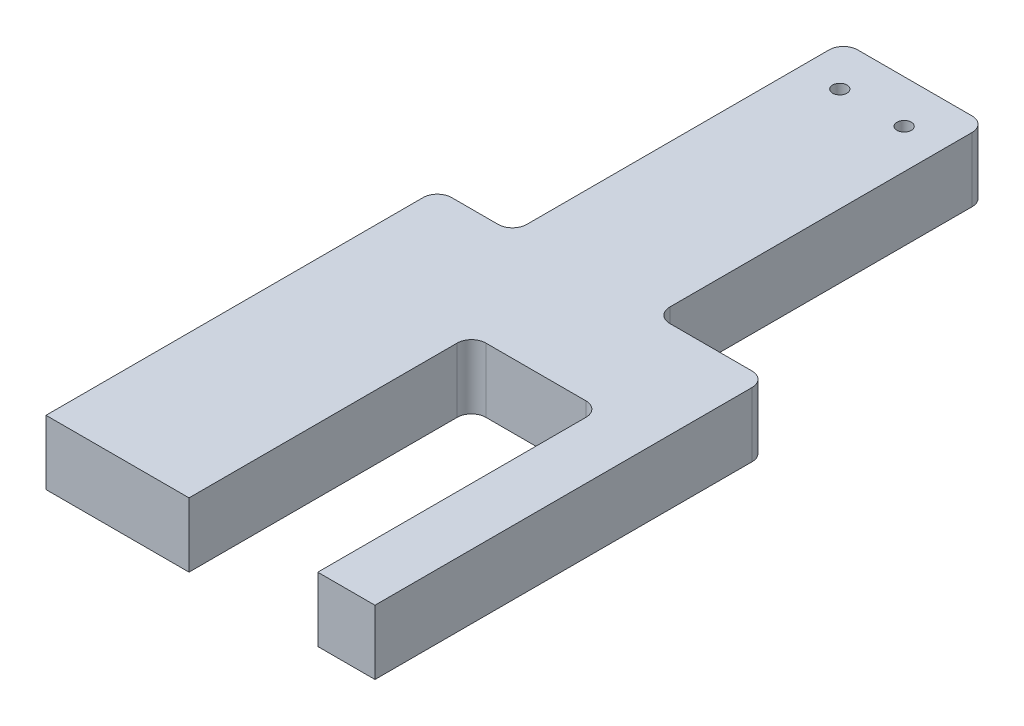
ISO-10303-21;
HEADER;
FILE_DESCRIPTION(('STEP AP214'),'2;1');
FILE_NAME('part.step','',(''),(''),'','','');
FILE_SCHEMA(('AUTOMOTIVE_DESIGN { 1 0 10303 214 1 1 1 1 }'));
ENDSEC;
DATA;
#1=APPLICATION_CONTEXT('core data for automotive mechanical design processes');
#2=APPLICATION_PROTOCOL_DEFINITION('international standard','automotive_design',2000,#1);
#3=PRODUCT_CONTEXT('',#1,'mechanical');
#4=PRODUCT('Part','Part','',(#3));
#5=PRODUCT_RELATED_PRODUCT_CATEGORY('part','',(#4));
#6=PRODUCT_DEFINITION_FORMATION('','',#4);
#7=PRODUCT_DEFINITION_CONTEXT('part definition',#1,'design');
#8=PRODUCT_DEFINITION('design','',#6,#7);
#9=PRODUCT_DEFINITION_SHAPE('','',#8);
#10=(LENGTH_UNIT() NAMED_UNIT(*) SI_UNIT(.MILLI.,.METRE.));
#11=(NAMED_UNIT(*) PLANE_ANGLE_UNIT() SI_UNIT($,.RADIAN.));
#12=(NAMED_UNIT(*) SI_UNIT($,.STERADIAN.) SOLID_ANGLE_UNIT());
#13=UNCERTAINTY_MEASURE_WITH_UNIT(LENGTH_MEASURE(1.E-05),#10,'distance_accuracy_value','');
#14=(GEOMETRIC_REPRESENTATION_CONTEXT(3) GLOBAL_UNCERTAINTY_ASSIGNED_CONTEXT((#13)) GLOBAL_UNIT_ASSIGNED_CONTEXT((#10,
#11,#12)) REPRESENTATION_CONTEXT('',''));
#15=CARTESIAN_POINT('',(0.,0.,0.));
#16=DIRECTION('',(0.,0.,1.));
#17=DIRECTION('',(1.,0.,0.));
#18=AXIS2_PLACEMENT_3D('',#15,#16,#17);
#19=CARTESIAN_POINT('',(0.,9.,0.));
#20=DIRECTION('',(0.,-1.,0.));
#21=DIRECTION('',(0.,0.,-1.));
#22=AXIS2_PLACEMENT_3D('',#19,#20,#21);
#23=PLANE('',#22);
#24=DIRECTION('',(0.,0.,-1.));
#25=VECTOR('',#24,1.);
#26=CARTESIAN_POINT('',(17.,9.,39.5));
#27=LINE('',#26,#25);
#28=CARTESIAN_POINT('',(17.,9.,39.5));
#29=VERTEX_POINT('',#28);
#30=CARTESIAN_POINT('',(17.,9.,-13.2275954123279));
#31=VERTEX_POINT('',#30);
#32=EDGE_CURVE('E241',#29,#31,#27,.T.);
#33=ORIENTED_EDGE('',*,*,#32,.T.);
#34=CARTESIAN_POINT('',(15.,9.,-13.2275954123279));
#35=DIRECTION('',(0.,-1.,0.));
#36=DIRECTION('',(0.,0.,-1.));
#37=AXIS2_PLACEMENT_3D('',#34,#35,#36);
#38=CIRCLE('',#37,2.);
#39=CARTESIAN_POINT('',(15.,9.,-15.2275954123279));
#40=VERTEX_POINT('',#39);
#41=EDGE_CURVE('E272',#31,#40,#38,.F.);
#42=ORIENTED_EDGE('',*,*,#41,.T.);
#43=DIRECTION('',(-1.,0.,0.));
#44=VECTOR('',#43,1.);
#45=CARTESIAN_POINT('',(1.5,9.,-15.2275954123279));
#46=LINE('',#45,#44);
#47=CARTESIAN_POINT('',(3.5,9.,-15.2275954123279));
#48=VERTEX_POINT('',#47);
#49=EDGE_CURVE('E339',#40,#48,#46,.T.);
#50=ORIENTED_EDGE('',*,*,#49,.T.);
#51=CARTESIAN_POINT('',(3.5,9.,-17.2275954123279));
#52=DIRECTION('',(0.,-1.,0.));
#53=DIRECTION('',(0.,0.,-1.));
#54=AXIS2_PLACEMENT_3D('',#51,#52,#53);
#55=CIRCLE('',#54,2.);
#56=CARTESIAN_POINT('',(1.5,9.,-17.2275954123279));
#57=VERTEX_POINT('',#56);
#58=EDGE_CURVE('E302',#48,#57,#55,.T.);
#59=ORIENTED_EDGE('',*,*,#58,.T.);
#60=DIRECTION('',(0.,0.,-1.));
#61=VECTOR('',#60,1.);
#62=CARTESIAN_POINT('',(1.49999999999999,9.,-61.5));
#63=LINE('',#62,#61);
#64=CARTESIAN_POINT('',(1.49999999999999,9.,-59.5));
#65=VERTEX_POINT('',#64);
#66=EDGE_CURVE('E336',#57,#65,#63,.T.);
#67=ORIENTED_EDGE('',*,*,#66,.T.);
#68=CARTESIAN_POINT('',(-0.500000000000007,9.,-59.5));
#69=DIRECTION('',(0.,-1.,0.));
#70=DIRECTION('',(0.,0.,-1.));
#71=AXIS2_PLACEMENT_3D('',#68,#69,#70);
#72=CIRCLE('',#71,2.);
#73=CARTESIAN_POINT('',(-0.500000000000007,9.,-61.5));
#74=VERTEX_POINT('',#73);
#75=EDGE_CURVE('E268',#65,#74,#72,.F.);
#76=ORIENTED_EDGE('',*,*,#75,.T.);
#77=DIRECTION('',(-1.,0.,0.));
#78=VECTOR('',#77,1.);
#79=CARTESIAN_POINT('',(-18.5,9.,-61.5));
#80=LINE('',#79,#78);
#81=CARTESIAN_POINT('',(-16.5,9.,-61.5));
#82=VERTEX_POINT('',#81);
#83=EDGE_CURVE('E331',#74,#82,#80,.T.);
#84=ORIENTED_EDGE('',*,*,#83,.T.);
#85=CARTESIAN_POINT('',(-16.5,9.,-59.5));
#86=DIRECTION('',(0.,-1.,0.));
#87=DIRECTION('',(0.,0.,-1.));
#88=AXIS2_PLACEMENT_3D('',#85,#86,#87);
#89=CIRCLE('',#88,2.);
#90=CARTESIAN_POINT('',(-18.5,9.,-59.5));
#91=VERTEX_POINT('',#90);
#92=EDGE_CURVE('E270',#82,#91,#89,.F.);
#93=ORIENTED_EDGE('',*,*,#92,.T.);
#94=DIRECTION('',(0.,0.,1.));
#95=VECTOR('',#94,1.);
#96=CARTESIAN_POINT('',(-18.5,9.,-15.2275954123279));
#97=LINE('',#96,#95);
#98=CARTESIAN_POINT('',(-18.5,9.,-17.2275954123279));
#99=VERTEX_POINT('',#98);
#100=EDGE_CURVE('E327',#91,#99,#97,.T.);
#101=ORIENTED_EDGE('',*,*,#100,.T.);
#102=CARTESIAN_POINT('',(-20.5,9.,-17.2275954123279));
#103=DIRECTION('',(0.,-1.,0.));
#104=DIRECTION('',(0.,0.,-1.));
#105=AXIS2_PLACEMENT_3D('',#102,#103,#104);
#106=CIRCLE('',#105,2.);
#107=CARTESIAN_POINT('',(-20.5,9.,-15.2275954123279));
#108=VERTEX_POINT('',#107);
#109=EDGE_CURVE('E11',#99,#108,#106,.T.);
#110=ORIENTED_EDGE('',*,*,#109,.T.);
#111=DIRECTION('',(-1.,0.,0.));
#112=VECTOR('',#111,1.);
#113=CARTESIAN_POINT('',(-29.,9.,-15.2275954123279));
#114=LINE('',#113,#112);
#115=CARTESIAN_POINT('',(-27.,9.,-15.2275954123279));
#116=VERTEX_POINT('',#115);
#117=EDGE_CURVE('E183',#108,#116,#114,.T.);
#118=ORIENTED_EDGE('',*,*,#117,.T.);
#119=CARTESIAN_POINT('',(-27.,9.,-13.2275954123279));
#120=DIRECTION('',(0.,-1.,0.));
#121=DIRECTION('',(0.,0.,-1.));
#122=AXIS2_PLACEMENT_3D('',#119,#120,#121);
#123=CIRCLE('',#122,2.);
#124=CARTESIAN_POINT('',(-29.,9.,-13.2275954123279));
#125=VERTEX_POINT('',#124);
#126=EDGE_CURVE('E179',#116,#125,#123,.F.);
#127=ORIENTED_EDGE('',*,*,#126,.T.);
#128=DIRECTION('',(0.,0.,1.));
#129=VECTOR('',#128,1.);
#130=CARTESIAN_POINT('',(-29.,9.,39.5));
#131=LINE('',#130,#129);
#132=CARTESIAN_POINT('',(-29.,9.,39.5));
#133=VERTEX_POINT('',#132);
#134=EDGE_CURVE('E169',#125,#133,#131,.T.);
#135=ORIENTED_EDGE('',*,*,#134,.T.);
#136=DIRECTION('',(1.,0.,0.));
#137=VECTOR('',#136,1.);
#138=CARTESIAN_POINT('',(-8.99999999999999,9.,39.5));
#139=LINE('',#138,#137);
#140=CARTESIAN_POINT('',(-8.99999999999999,9.,39.5));
#141=VERTEX_POINT('',#140);
#142=EDGE_CURVE('E175',#133,#141,#139,.T.);
#143=ORIENTED_EDGE('',*,*,#142,.T.);
#144=DIRECTION('',(0.,0.,-1.));
#145=VECTOR('',#144,1.);
#146=CARTESIAN_POINT('',(-9.,9.,0.));
#147=LINE('',#146,#145);
#148=CARTESIAN_POINT('',(-9.,9.,2.));
#149=VERTEX_POINT('',#148);
#150=EDGE_CURVE('E198',#141,#149,#147,.T.);
#151=ORIENTED_EDGE('',*,*,#150,.T.);
#152=CARTESIAN_POINT('',(-7.,9.,2.));
#153=DIRECTION('',(0.,-1.,0.));
#154=DIRECTION('',(0.,0.,-1.));
#155=AXIS2_PLACEMENT_3D('',#152,#153,#154);
#156=CIRCLE('',#155,2.);
#157=CARTESIAN_POINT('',(-7.,9.,0.));
#158=VERTEX_POINT('',#157);
#159=EDGE_CURVE('E309',#149,#158,#156,.T.);
#160=ORIENTED_EDGE('',*,*,#159,.T.);
#161=DIRECTION('',(1.,0.,0.));
#162=VECTOR('',#161,1.);
#163=CARTESIAN_POINT('',(-9.,9.,0.));
#164=LINE('',#163,#162);
#165=CARTESIAN_POINT('',(7.,9.,0.));
#166=VERTEX_POINT('',#165);
#167=EDGE_CURVE('E200',#158,#166,#164,.T.);
#168=ORIENTED_EDGE('',*,*,#167,.T.);
#169=CARTESIAN_POINT('',(7.,9.,2.));
#170=DIRECTION('',(0.,-1.,0.));
#171=DIRECTION('',(0.,0.,-1.));
#172=AXIS2_PLACEMENT_3D('',#169,#170,#171);
#173=CIRCLE('',#172,2.);
#174=CARTESIAN_POINT('',(9.,9.,2.));
#175=VERTEX_POINT('',#174);
#176=EDGE_CURVE('E48',#166,#175,#173,.T.);
#177=ORIENTED_EDGE('',*,*,#176,.T.);
#178=DIRECTION('',(0.,0.,1.));
#179=VECTOR('',#178,1.);
#180=CARTESIAN_POINT('',(9.,9.,0.));
#181=LINE('',#180,#179);
#182=CARTESIAN_POINT('',(9.00000000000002,9.,39.5));
#183=VERTEX_POINT('',#182);
#184=EDGE_CURVE('E205',#175,#183,#181,.T.);
#185=ORIENTED_EDGE('',*,*,#184,.T.);
#186=DIRECTION('',(1.,0.,0.));
#187=VECTOR('',#186,1.);
#188=CARTESIAN_POINT('',(9.00000000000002,9.,39.5));
#189=LINE('',#188,#187);
#190=EDGE_CURVE('E207',#183,#29,#189,.T.);
#191=ORIENTED_EDGE('',*,*,#190,.T.);
#192=EDGE_LOOP('',(#33,#42,#50,#59,#67,#76,#84,#93,#101,#110,#118,#127,#135,#143,#151,#160,#168,
#177,#185,#191));
#193=FACE_BOUND('',#192,.T.);
#194=CARTESIAN_POINT('',(-4.00000000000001,9.,-55.5));
#195=DIRECTION('',(0.,1.,0.));
#196=DIRECTION('',(0.,0.,1.));
#197=AXIS2_PLACEMENT_3D('',#194,#195,#196);
#198=CIRCLE('',#197,1.);
#199=CARTESIAN_POINT('',(-4.00000000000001,9.,-54.5));
#200=VERTEX_POINT('',#199);
#201=EDGE_CURVE('E214',#200,#200,#198,.T.);
#202=ORIENTED_EDGE('',*,*,#201,.F.);
#203=EDGE_LOOP('',(#202));
#204=FACE_BOUND('',#203,.T.);
#205=CARTESIAN_POINT('',(-13.,9.,-55.5));
#206=DIRECTION('',(0.,1.,0.));
#207=DIRECTION('',(0.,0.,1.));
#208=AXIS2_PLACEMENT_3D('',#205,#206,#207);
#209=CIRCLE('',#208,1.);
#210=CARTESIAN_POINT('',(-13.,9.,-54.5));
#211=VERTEX_POINT('',#210);
#212=EDGE_CURVE('E346',#211,#211,#209,.T.);
#213=ORIENTED_EDGE('',*,*,#212,.F.);
#214=EDGE_LOOP('',(#213));
#215=FACE_BOUND('',#214,.T.);
#216=ADVANCED_FACE('F33',(#193,#204,#215),#23,.F.);
#217=CARTESIAN_POINT('',(0.,0.,0.));
#218=DIRECTION('',(0.,-1.,0.));
#219=DIRECTION('',(0.,0.,-1.));
#220=AXIS2_PLACEMENT_3D('',#217,#218,#219);
#221=PLANE('',#220);
#222=CARTESIAN_POINT('',(-4.00000000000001,0.,-55.5));
#223=DIRECTION('',(0.,1.,0.));
#224=DIRECTION('',(0.,0.,1.));
#225=AXIS2_PLACEMENT_3D('',#222,#223,#224);
#226=CIRCLE('',#225,1.);
#227=CARTESIAN_POINT('',(-4.00000000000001,0.,-54.5));
#228=VERTEX_POINT('',#227);
#229=EDGE_CURVE('E343',#228,#228,#226,.T.);
#230=ORIENTED_EDGE('',*,*,#229,.T.);
#231=EDGE_LOOP('',(#230));
#232=FACE_BOUND('',#231,.T.);
#233=DIRECTION('',(-1.,0.,0.));
#234=VECTOR('',#233,1.);
#235=CARTESIAN_POINT('',(1.5,0.,-15.2275954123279));
#236=LINE('',#235,#234);
#237=CARTESIAN_POINT('',(15.,0.,-15.2275954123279));
#238=VERTEX_POINT('',#237);
#239=CARTESIAN_POINT('',(3.5,0.,-15.2275954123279));
#240=VERTEX_POINT('',#239);
#241=EDGE_CURVE('E213',#238,#240,#236,.T.);
#242=ORIENTED_EDGE('',*,*,#241,.F.);
#243=CARTESIAN_POINT('',(15.,0.,-13.2275954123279));
#244=DIRECTION('',(0.,-1.,0.));
#245=DIRECTION('',(0.,0.,-1.));
#246=AXIS2_PLACEMENT_3D('',#243,#244,#245);
#247=CIRCLE('',#246,2.);
#248=CARTESIAN_POINT('',(17.,0.,-13.2275954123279));
#249=VERTEX_POINT('',#248);
#250=EDGE_CURVE('E263',#238,#249,#247,.T.);
#251=ORIENTED_EDGE('',*,*,#250,.T.);
#252=DIRECTION('',(0.,0.,-1.));
#253=VECTOR('',#252,1.);
#254=CARTESIAN_POINT('',(17.,0.,39.5));
#255=LINE('',#254,#253);
#256=CARTESIAN_POINT('',(17.,0.,39.5));
#257=VERTEX_POINT('',#256);
#258=EDGE_CURVE('E210',#257,#249,#255,.T.);
#259=ORIENTED_EDGE('',*,*,#258,.F.);
#260=DIRECTION('',(1.,0.,0.));
#261=VECTOR('',#260,1.);
#262=CARTESIAN_POINT('',(9.00000000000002,0.,39.5));
#263=LINE('',#262,#261);
#264=CARTESIAN_POINT('',(9.00000000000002,0.,39.5));
#265=VERTEX_POINT('',#264);
#266=EDGE_CURVE('E239',#265,#257,#263,.T.);
#267=ORIENTED_EDGE('',*,*,#266,.F.);
#268=DIRECTION('',(0.,0.,1.));
#269=VECTOR('',#268,1.);
#270=CARTESIAN_POINT('',(9.,0.,0.));
#271=LINE('',#270,#269);
#272=CARTESIAN_POINT('',(9.,0.,2.));
#273=VERTEX_POINT('',#272);
#274=EDGE_CURVE('E237',#273,#265,#271,.T.);
#275=ORIENTED_EDGE('',*,*,#274,.F.);
#276=CARTESIAN_POINT('',(7.,0.,2.));
#277=DIRECTION('',(0.,-1.,0.));
#278=DIRECTION('',(0.,0.,-1.));
#279=AXIS2_PLACEMENT_3D('',#276,#277,#278);
#280=CIRCLE('',#279,2.);
#281=CARTESIAN_POINT('',(7.,0.,0.));
#282=VERTEX_POINT('',#281);
#283=EDGE_CURVE('E304',#273,#282,#280,.F.);
#284=ORIENTED_EDGE('',*,*,#283,.T.);
#285=DIRECTION('',(1.,0.,0.));
#286=VECTOR('',#285,1.);
#287=CARTESIAN_POINT('',(-9.,0.,0.));
#288=LINE('',#287,#286);
#289=CARTESIAN_POINT('',(-7.,0.,0.));
#290=VERTEX_POINT('',#289);
#291=EDGE_CURVE('E235',#290,#282,#288,.T.);
#292=ORIENTED_EDGE('',*,*,#291,.F.);
#293=CARTESIAN_POINT('',(-7.,0.,2.));
#294=DIRECTION('',(0.,-1.,0.));
#295=DIRECTION('',(0.,0.,-1.));
#296=AXIS2_PLACEMENT_3D('',#293,#294,#295);
#297=CIRCLE('',#296,2.);
#298=CARTESIAN_POINT('',(-9.,0.,2.));
#299=VERTEX_POINT('',#298);
#300=EDGE_CURVE('E307',#290,#299,#297,.F.);
#301=ORIENTED_EDGE('',*,*,#300,.T.);
#302=DIRECTION('',(0.,0.,-1.));
#303=VECTOR('',#302,1.);
#304=CARTESIAN_POINT('',(-9.,0.,0.));
#305=LINE('',#304,#303);
#306=CARTESIAN_POINT('',(-8.99999999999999,0.,39.5));
#307=VERTEX_POINT('',#306);
#308=EDGE_CURVE('E232',#307,#299,#305,.T.);
#309=ORIENTED_EDGE('',*,*,#308,.F.);
#310=DIRECTION('',(1.,0.,0.));
#311=VECTOR('',#310,1.);
#312=CARTESIAN_POINT('',(-8.99999999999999,0.,39.5));
#313=LINE('',#312,#311);
#314=CARTESIAN_POINT('',(-29.,0.,39.5));
#315=VERTEX_POINT('',#314);
#316=EDGE_CURVE('E230',#315,#307,#313,.T.);
#317=ORIENTED_EDGE('',*,*,#316,.F.);
#318=DIRECTION('',(0.,0.,1.));
#319=VECTOR('',#318,1.);
#320=CARTESIAN_POINT('',(-29.,0.,39.5));
#321=LINE('',#320,#319);
#322=CARTESIAN_POINT('',(-29.,0.,-13.2275954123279));
#323=VERTEX_POINT('',#322);
#324=EDGE_CURVE('E189',#323,#315,#321,.T.);
#325=ORIENTED_EDGE('',*,*,#324,.F.);
#326=CARTESIAN_POINT('',(-27.,0.,-13.2275954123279));
#327=DIRECTION('',(0.,-1.,0.));
#328=DIRECTION('',(0.,0.,-1.));
#329=AXIS2_PLACEMENT_3D('',#326,#327,#328);
#330=CIRCLE('',#329,2.);
#331=CARTESIAN_POINT('',(-27.,0.,-15.2275954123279));
#332=VERTEX_POINT('',#331);
#333=EDGE_CURVE('E257',#323,#332,#330,.T.);
#334=ORIENTED_EDGE('',*,*,#333,.T.);
#335=DIRECTION('',(-1.,0.,0.));
#336=VECTOR('',#335,1.);
#337=CARTESIAN_POINT('',(-29.,0.,-15.2275954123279));
#338=LINE('',#337,#336);
#339=CARTESIAN_POINT('',(-20.5,0.,-15.2275954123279));
#340=VERTEX_POINT('',#339);
#341=EDGE_CURVE('E226',#340,#332,#338,.T.);
#342=ORIENTED_EDGE('',*,*,#341,.F.);
#343=CARTESIAN_POINT('',(-20.5,0.,-17.2275954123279));
#344=DIRECTION('',(0.,-1.,0.));
#345=DIRECTION('',(0.,0.,-1.));
#346=AXIS2_PLACEMENT_3D('',#343,#344,#345);
#347=CIRCLE('',#346,2.);
#348=CARTESIAN_POINT('',(-18.5,0.,-17.2275954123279));
#349=VERTEX_POINT('',#348);
#350=EDGE_CURVE('E41',#340,#349,#347,.F.);
#351=ORIENTED_EDGE('',*,*,#350,.T.);
#352=DIRECTION('',(0.,0.,1.));
#353=VECTOR('',#352,1.);
#354=CARTESIAN_POINT('',(-18.5,0.,-15.2275954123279));
#355=LINE('',#354,#353);
#356=CARTESIAN_POINT('',(-18.5,0.,-59.5));
#357=VERTEX_POINT('',#356);
#358=EDGE_CURVE('E223',#357,#349,#355,.T.);
#359=ORIENTED_EDGE('',*,*,#358,.F.);
#360=CARTESIAN_POINT('',(-16.5,0.,-59.5));
#361=DIRECTION('',(0.,-1.,0.));
#362=DIRECTION('',(0.,0.,-1.));
#363=AXIS2_PLACEMENT_3D('',#360,#361,#362);
#364=CIRCLE('',#363,2.);
#365=CARTESIAN_POINT('',(-16.5,0.,-61.5));
#366=VERTEX_POINT('',#365);
#367=EDGE_CURVE('E261',#357,#366,#364,.T.);
#368=ORIENTED_EDGE('',*,*,#367,.T.);
#369=DIRECTION('',(-1.,0.,0.));
#370=VECTOR('',#369,1.);
#371=CARTESIAN_POINT('',(-18.5,0.,-61.5));
#372=LINE('',#371,#370);
#373=CARTESIAN_POINT('',(-0.500000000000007,0.,-61.5));
#374=VERTEX_POINT('',#373);
#375=EDGE_CURVE('E220',#374,#366,#372,.T.);
#376=ORIENTED_EDGE('',*,*,#375,.F.);
#377=CARTESIAN_POINT('',(-0.500000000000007,0.,-59.5));
#378=DIRECTION('',(0.,-1.,0.));
#379=DIRECTION('',(0.,0.,-1.));
#380=AXIS2_PLACEMENT_3D('',#377,#378,#379);
#381=CIRCLE('',#380,2.);
#382=CARTESIAN_POINT('',(1.49999999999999,0.,-59.5));
#383=VERTEX_POINT('',#382);
#384=EDGE_CURVE('E259',#374,#383,#381,.T.);
#385=ORIENTED_EDGE('',*,*,#384,.T.);
#386=DIRECTION('',(0.,0.,-1.));
#387=VECTOR('',#386,1.);
#388=CARTESIAN_POINT('',(1.49999999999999,0.,-61.5));
#389=LINE('',#388,#387);
#390=CARTESIAN_POINT('',(1.5,0.,-17.2275954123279));
#391=VERTEX_POINT('',#390);
#392=EDGE_CURVE('E217',#391,#383,#389,.T.);
#393=ORIENTED_EDGE('',*,*,#392,.F.);
#394=CARTESIAN_POINT('',(3.5,0.,-17.2275954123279));
#395=DIRECTION('',(0.,-1.,0.));
#396=DIRECTION('',(0.,0.,-1.));
#397=AXIS2_PLACEMENT_3D('',#394,#395,#396);
#398=CIRCLE('',#397,2.);
#399=EDGE_CURVE('E300',#391,#240,#398,.F.);
#400=ORIENTED_EDGE('',*,*,#399,.T.);
#401=EDGE_LOOP('',(#242,#251,#259,#267,#275,#284,#292,#301,#309,#317,#325,#334,#342,#351,#359,
#368,#376,#385,#393,#400));
#402=FACE_BOUND('',#401,.T.);
#403=CARTESIAN_POINT('',(-13.,0.,-55.5));
#404=DIRECTION('',(0.,1.,0.));
#405=DIRECTION('',(0.,0.,1.));
#406=AXIS2_PLACEMENT_3D('',#403,#404,#405);
#407=CIRCLE('',#406,1.);
#408=CARTESIAN_POINT('',(-13.,0.,-54.5));
#409=VERTEX_POINT('',#408);
#410=EDGE_CURVE('E349',#409,#409,#407,.T.);
#411=ORIENTED_EDGE('',*,*,#410,.T.);
#412=EDGE_LOOP('',(#411));
#413=FACE_BOUND('',#412,.T.);
#414=ADVANCED_FACE('F314',(#232,#402,#413),#221,.T.);
#415=CARTESIAN_POINT('',(17.,9.,39.5));
#416=DIRECTION('',(-1.,0.,0.));
#417=DIRECTION('',(0.,0.,1.));
#418=AXIS2_PLACEMENT_3D('',#415,#416,#417);
#419=PLANE('',#418);
#420=ORIENTED_EDGE('',*,*,#258,.T.);
#421=DIRECTION('',(0.,-1.,0.));
#422=VECTOR('',#421,1.);
#423=CARTESIAN_POINT('',(17.,9.,-13.2275954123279));
#424=LINE('',#423,#422);
#425=EDGE_CURVE('E265',#249,#31,#424,.F.);
#426=ORIENTED_EDGE('',*,*,#425,.T.);
#427=ORIENTED_EDGE('',*,*,#32,.F.);
#428=DIRECTION('',(0.,-1.,0.));
#429=VECTOR('',#428,1.);
#430=CARTESIAN_POINT('',(17.,9.,39.5));
#431=LINE('',#430,#429);
#432=EDGE_CURVE('E209',#29,#257,#431,.T.);
#433=ORIENTED_EDGE('',*,*,#432,.T.);
#434=EDGE_LOOP('',(#420,#426,#427,#433));
#435=FACE_BOUND('',#434,.T.);
#436=ADVANCED_FACE('F363',(#435),#419,.F.);
#437=CARTESIAN_POINT('',(1.5,9.,-15.2275954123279));
#438=DIRECTION('',(0.,0.,1.));
#439=DIRECTION('',(1.,0.,0.));
#440=AXIS2_PLACEMENT_3D('',#437,#438,#439);
#441=PLANE('',#440);
#442=ORIENTED_EDGE('',*,*,#241,.T.);
#443=DIRECTION('',(0.,-1.,0.));
#444=VECTOR('',#443,1.);
#445=CARTESIAN_POINT('',(3.5,9.,-15.2275954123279));
#446=LINE('',#445,#444);
#447=EDGE_CURVE('E255',#240,#48,#446,.F.);
#448=ORIENTED_EDGE('',*,*,#447,.T.);
#449=ORIENTED_EDGE('',*,*,#49,.F.);
#450=DIRECTION('',(0.,-1.,0.));
#451=VECTOR('',#450,1.);
#452=CARTESIAN_POINT('',(15.,9.,-15.2275954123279));
#453=LINE('',#452,#451);
#454=EDGE_CURVE('E252',#40,#238,#453,.T.);
#455=ORIENTED_EDGE('',*,*,#454,.T.);
#456=EDGE_LOOP('',(#442,#448,#449,#455));
#457=FACE_BOUND('',#456,.T.);
#458=ADVANCED_FACE('F400',(#457),#441,.F.);
#459=CARTESIAN_POINT('',(1.49999999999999,9.,-61.5));
#460=DIRECTION('',(-1.,0.,0.));
#461=DIRECTION('',(0.,0.,1.));
#462=AXIS2_PLACEMENT_3D('',#459,#460,#461);
#463=PLANE('',#462);
#464=ORIENTED_EDGE('',*,*,#66,.F.);
#465=DIRECTION('',(0.,-1.,0.));
#466=VECTOR('',#465,1.);
#467=CARTESIAN_POINT('',(1.5,0.,-17.2275954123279));
#468=LINE('',#467,#466);
#469=EDGE_CURVE('E249',#57,#391,#468,.T.);
#470=ORIENTED_EDGE('',*,*,#469,.T.);
#471=ORIENTED_EDGE('',*,*,#392,.T.);
#472=DIRECTION('',(0.,-1.,0.));
#473=VECTOR('',#472,1.);
#474=CARTESIAN_POINT('',(1.49999999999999,9.,-59.5));
#475=LINE('',#474,#473);
#476=EDGE_CURVE('E192',#383,#65,#475,.F.);
#477=ORIENTED_EDGE('',*,*,#476,.T.);
#478=EDGE_LOOP('',(#464,#470,#471,#477));
#479=FACE_BOUND('',#478,.T.);
#480=ADVANCED_FACE('F396',(#479),#463,.F.);
#481=CARTESIAN_POINT('',(-18.5,9.,-61.5));
#482=DIRECTION('',(0.,0.,1.));
#483=DIRECTION('',(1.,0.,0.));
#484=AXIS2_PLACEMENT_3D('',#481,#482,#483);
#485=PLANE('',#484);
#486=ORIENTED_EDGE('',*,*,#375,.T.);
#487=DIRECTION('',(0.,-1.,0.));
#488=VECTOR('',#487,1.);
#489=CARTESIAN_POINT('',(-16.5,9.,-61.5));
#490=LINE('',#489,#488);
#491=EDGE_CURVE('E291',#366,#82,#490,.F.);
#492=ORIENTED_EDGE('',*,*,#491,.T.);
#493=ORIENTED_EDGE('',*,*,#83,.F.);
#494=DIRECTION('',(0.,-1.,0.));
#495=VECTOR('',#494,1.);
#496=CARTESIAN_POINT('',(-0.500000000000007,9.,-61.5));
#497=LINE('',#496,#495);
#498=EDGE_CURVE('E288',#74,#374,#497,.T.);
#499=ORIENTED_EDGE('',*,*,#498,.T.);
#500=EDGE_LOOP('',(#486,#492,#493,#499));
#501=FACE_BOUND('',#500,.T.);
#502=ADVANCED_FACE('F393',(#501),#485,.F.);
#503=CARTESIAN_POINT('',(-18.5,9.,-15.2275954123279));
#504=DIRECTION('',(1.,0.,0.));
#505=DIRECTION('',(0.,0.,-1.));
#506=AXIS2_PLACEMENT_3D('',#503,#504,#505);
#507=PLANE('',#506);
#508=ORIENTED_EDGE('',*,*,#100,.F.);
#509=DIRECTION('',(0.,-1.,0.));
#510=VECTOR('',#509,1.);
#511=CARTESIAN_POINT('',(-18.5,9.,-59.5));
#512=LINE('',#511,#510);
#513=EDGE_CURVE('E285',#91,#357,#512,.T.);
#514=ORIENTED_EDGE('',*,*,#513,.T.);
#515=ORIENTED_EDGE('',*,*,#358,.T.);
#516=DIRECTION('',(0.,-1.,0.));
#517=VECTOR('',#516,1.);
#518=CARTESIAN_POINT('',(-18.5,9.,-17.2275954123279));
#519=LINE('',#518,#517);
#520=EDGE_CURVE('E283',#349,#99,#519,.F.);
#521=ORIENTED_EDGE('',*,*,#520,.T.);
#522=EDGE_LOOP('',(#508,#514,#515,#521));
#523=FACE_BOUND('',#522,.T.);
#524=ADVANCED_FACE('F321',(#523),#507,.F.);
#525=CARTESIAN_POINT('',(-29.,9.,-15.2275954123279));
#526=DIRECTION('',(0.,0.,1.));
#527=DIRECTION('',(1.,0.,0.));
#528=AXIS2_PLACEMENT_3D('',#525,#526,#527);
#529=PLANE('',#528);
#530=ORIENTED_EDGE('',*,*,#117,.F.);
#531=DIRECTION('',(0.,-1.,0.));
#532=VECTOR('',#531,1.);
#533=CARTESIAN_POINT('',(-20.5,0.,-15.2275954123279));
#534=LINE('',#533,#532);
#535=EDGE_CURVE('E295',#108,#340,#534,.T.);
#536=ORIENTED_EDGE('',*,*,#535,.T.);
#537=ORIENTED_EDGE('',*,*,#341,.T.);
#538=DIRECTION('',(0.,-1.,0.));
#539=VECTOR('',#538,1.);
#540=CARTESIAN_POINT('',(-27.,9.,-15.2275954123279));
#541=LINE('',#540,#539);
#542=EDGE_CURVE('E293',#332,#116,#541,.F.);
#543=ORIENTED_EDGE('',*,*,#542,.T.);
#544=EDGE_LOOP('',(#530,#536,#537,#543));
#545=FACE_BOUND('',#544,.T.);
#546=ADVANCED_FACE('F329',(#545),#529,.F.);
#547=CARTESIAN_POINT('',(-29.,9.,39.5));
#548=DIRECTION('',(1.,0.,0.));
#549=DIRECTION('',(0.,0.,-1.));
#550=AXIS2_PLACEMENT_3D('',#547,#548,#549);
#551=PLANE('',#550);
#552=ORIENTED_EDGE('',*,*,#134,.F.);
#553=DIRECTION('',(0.,-1.,0.));
#554=VECTOR('',#553,1.);
#555=CARTESIAN_POINT('',(-29.,9.,-13.2275954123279));
#556=LINE('',#555,#554);
#557=EDGE_CURVE('E298',#125,#323,#556,.T.);
#558=ORIENTED_EDGE('',*,*,#557,.T.);
#559=ORIENTED_EDGE('',*,*,#324,.T.);
#560=DIRECTION('',(0.,-1.,0.));
#561=VECTOR('',#560,1.);
#562=CARTESIAN_POINT('',(-29.,9.,39.5));
#563=LINE('',#562,#561);
#564=EDGE_CURVE('E186',#133,#315,#563,.T.);
#565=ORIENTED_EDGE('',*,*,#564,.F.);
#566=EDGE_LOOP('',(#552,#558,#559,#565));
#567=FACE_BOUND('',#566,.T.);
#568=ADVANCED_FACE('F187',(#567),#551,.F.);
#569=CARTESIAN_POINT('',(-8.99999999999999,9.,39.5));
#570=DIRECTION('',(0.,0.,-1.));
#571=DIRECTION('',(-1.,0.,0.));
#572=AXIS2_PLACEMENT_3D('',#569,#570,#571);
#573=PLANE('',#572);
#574=ORIENTED_EDGE('',*,*,#316,.T.);
#575=DIRECTION('',(0.,-1.,0.));
#576=VECTOR('',#575,1.);
#577=CARTESIAN_POINT('',(-8.99999999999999,9.,39.5));
#578=LINE('',#577,#576);
#579=EDGE_CURVE('E193',#141,#307,#578,.T.);
#580=ORIENTED_EDGE('',*,*,#579,.F.);
#581=ORIENTED_EDGE('',*,*,#142,.F.);
#582=ORIENTED_EDGE('',*,*,#564,.T.);
#583=EDGE_LOOP('',(#574,#580,#581,#582));
#584=FACE_BOUND('',#583,.T.);
#585=ADVANCED_FACE('F195',(#584),#573,.F.);
#586=CARTESIAN_POINT('',(-9.,9.,0.));
#587=DIRECTION('',(-1.,0.,0.));
#588=DIRECTION('',(0.,0.,1.));
#589=AXIS2_PLACEMENT_3D('',#586,#587,#588);
#590=PLANE('',#589);
#591=ORIENTED_EDGE('',*,*,#308,.T.);
#592=DIRECTION('',(0.,-1.,0.));
#593=VECTOR('',#592,1.);
#594=CARTESIAN_POINT('',(-9.,9.,2.));
#595=LINE('',#594,#593);
#596=EDGE_CURVE('E281',#299,#149,#595,.F.);
#597=ORIENTED_EDGE('',*,*,#596,.T.);
#598=ORIENTED_EDGE('',*,*,#150,.F.);
#599=ORIENTED_EDGE('',*,*,#579,.T.);
#600=EDGE_LOOP('',(#591,#597,#598,#599));
#601=FACE_BOUND('',#600,.T.);
#602=ADVANCED_FACE('F381',(#601),#590,.F.);
#603=CARTESIAN_POINT('',(-9.,9.,0.));
#604=DIRECTION('',(0.,0.,-1.));
#605=DIRECTION('',(-1.,0.,0.));
#606=AXIS2_PLACEMENT_3D('',#603,#604,#605);
#607=PLANE('',#606);
#608=ORIENTED_EDGE('',*,*,#291,.T.);
#609=DIRECTION('',(0.,-1.,0.));
#610=VECTOR('',#609,1.);
#611=CARTESIAN_POINT('',(7.,9.,0.));
#612=LINE('',#611,#610);
#613=EDGE_CURVE('E56',#282,#166,#612,.F.);
#614=ORIENTED_EDGE('',*,*,#613,.T.);
#615=ORIENTED_EDGE('',*,*,#167,.F.);
#616=DIRECTION('',(0.,-1.,0.));
#617=VECTOR('',#616,1.);
#618=CARTESIAN_POINT('',(-7.,0.,0.));
#619=LINE('',#618,#617);
#620=EDGE_CURVE('E277',#158,#290,#619,.T.);
#621=ORIENTED_EDGE('',*,*,#620,.T.);
#622=EDGE_LOOP('',(#608,#614,#615,#621));
#623=FACE_BOUND('',#622,.T.);
#624=ADVANCED_FACE('F377',(#623),#607,.F.);
#625=CARTESIAN_POINT('',(9.,9.,0.));
#626=DIRECTION('',(1.,0.,0.));
#627=DIRECTION('',(0.,0.,-1.));
#628=AXIS2_PLACEMENT_3D('',#625,#626,#627);
#629=PLANE('',#628);
#630=ORIENTED_EDGE('',*,*,#184,.F.);
#631=DIRECTION('',(0.,-1.,0.));
#632=VECTOR('',#631,1.);
#633=CARTESIAN_POINT('',(9.,0.,2.));
#634=LINE('',#633,#632);
#635=EDGE_CURVE('E274',#175,#273,#634,.T.);
#636=ORIENTED_EDGE('',*,*,#635,.T.);
#637=ORIENTED_EDGE('',*,*,#274,.T.);
#638=DIRECTION('',(0.,-1.,0.));
#639=VECTOR('',#638,1.);
#640=CARTESIAN_POINT('',(9.00000000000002,9.,39.5));
#641=LINE('',#640,#639);
#642=EDGE_CURVE('E244',#183,#265,#641,.T.);
#643=ORIENTED_EDGE('',*,*,#642,.F.);
#644=EDGE_LOOP('',(#630,#636,#637,#643));
#645=FACE_BOUND('',#644,.T.);
#646=ADVANCED_FACE('F373',(#645),#629,.F.);
#647=CARTESIAN_POINT('',(9.00000000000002,9.,39.5));
#648=DIRECTION('',(0.,0.,-1.));
#649=DIRECTION('',(-1.,0.,0.));
#650=AXIS2_PLACEMENT_3D('',#647,#648,#649);
#651=PLANE('',#650);
#652=ORIENTED_EDGE('',*,*,#266,.T.);
#653=ORIENTED_EDGE('',*,*,#432,.F.);
#654=ORIENTED_EDGE('',*,*,#190,.F.);
#655=ORIENTED_EDGE('',*,*,#642,.T.);
#656=EDGE_LOOP('',(#652,#653,#654,#655));
#657=FACE_BOUND('',#656,.T.);
#658=ADVANCED_FACE('F370',(#657),#651,.F.);
#659=CARTESIAN_POINT('',(-4.00000000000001,9.,-55.5));
#660=DIRECTION('',(0.,-1.,0.));
#661=DIRECTION('',(0.,0.,-1.));
#662=AXIS2_PLACEMENT_3D('',#659,#660,#661);
#663=CYLINDRICAL_SURFACE('',#662,1.);
#664=ORIENTED_EDGE('',*,*,#201,.T.);
#665=EDGE_LOOP('',(#664));
#666=FACE_BOUND('',#665,.T.);
#667=ORIENTED_EDGE('',*,*,#229,.F.);
#668=EDGE_LOOP('',(#667));
#669=FACE_BOUND('',#668,.T.);
#670=ADVANCED_FACE('F367',(#666,#669),#663,.F.);
#671=CARTESIAN_POINT('',(-13.,9.,-55.5));
#672=DIRECTION('',(0.,-1.,0.));
#673=DIRECTION('',(0.,0.,-1.));
#674=AXIS2_PLACEMENT_3D('',#671,#672,#673);
#675=CYLINDRICAL_SURFACE('',#674,1.);
#676=ORIENTED_EDGE('',*,*,#212,.T.);
#677=EDGE_LOOP('',(#676));
#678=FACE_BOUND('',#677,.T.);
#679=ORIENTED_EDGE('',*,*,#410,.F.);
#680=EDGE_LOOP('',(#679));
#681=FACE_BOUND('',#680,.T.);
#682=ADVANCED_FACE('F355',(#678,#681),#675,.F.);
#683=CARTESIAN_POINT('',(3.5,9.,-17.2275954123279));
#684=DIRECTION('',(0.,1.,0.));
#685=DIRECTION('',(0.,0.,1.));
#686=AXIS2_PLACEMENT_3D('',#683,#684,#685);
#687=CYLINDRICAL_SURFACE('',#686,2.);
#688=ORIENTED_EDGE('',*,*,#58,.F.);
#689=ORIENTED_EDGE('',*,*,#447,.F.);
#690=ORIENTED_EDGE('',*,*,#399,.F.);
#691=ORIENTED_EDGE('',*,*,#469,.F.);
#692=EDGE_LOOP('',(#688,#689,#690,#691));
#693=FACE_BOUND('',#692,.T.);
#694=ADVANCED_FACE('F408',(#693),#687,.F.);
#695=CARTESIAN_POINT('',(15.,9.,-13.2275954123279));
#696=DIRECTION('',(0.,-1.,0.));
#697=DIRECTION('',(0.,0.,-1.));
#698=AXIS2_PLACEMENT_3D('',#695,#696,#697);
#699=CYLINDRICAL_SURFACE('',#698,2.);
#700=ORIENTED_EDGE('',*,*,#41,.F.);
#701=ORIENTED_EDGE('',*,*,#425,.F.);
#702=ORIENTED_EDGE('',*,*,#250,.F.);
#703=ORIENTED_EDGE('',*,*,#454,.F.);
#704=EDGE_LOOP('',(#700,#701,#702,#703));
#705=FACE_BOUND('',#704,.T.);
#706=ADVANCED_FACE('F411',(#705),#699,.T.);
#707=CARTESIAN_POINT('',(7.,9.,2.));
#708=DIRECTION('',(0.,1.,0.));
#709=DIRECTION('',(0.,0.,1.));
#710=AXIS2_PLACEMENT_3D('',#707,#708,#709);
#711=CYLINDRICAL_SURFACE('',#710,2.);
#712=ORIENTED_EDGE('',*,*,#176,.F.);
#713=ORIENTED_EDGE('',*,*,#613,.F.);
#714=ORIENTED_EDGE('',*,*,#283,.F.);
#715=ORIENTED_EDGE('',*,*,#635,.F.);
#716=EDGE_LOOP('',(#712,#713,#714,#715));
#717=FACE_BOUND('',#716,.T.);
#718=ADVANCED_FACE('F415',(#717),#711,.F.);
#719=CARTESIAN_POINT('',(-7.,9.,2.));
#720=DIRECTION('',(0.,1.,0.));
#721=DIRECTION('',(0.,0.,1.));
#722=AXIS2_PLACEMENT_3D('',#719,#720,#721);
#723=CYLINDRICAL_SURFACE('',#722,2.);
#724=ORIENTED_EDGE('',*,*,#159,.F.);
#725=ORIENTED_EDGE('',*,*,#596,.F.);
#726=ORIENTED_EDGE('',*,*,#300,.F.);
#727=ORIENTED_EDGE('',*,*,#620,.F.);
#728=EDGE_LOOP('',(#724,#725,#726,#727));
#729=FACE_BOUND('',#728,.T.);
#730=ADVANCED_FACE('F419',(#729),#723,.F.);
#731=CARTESIAN_POINT('',(-16.5,9.,-59.5));
#732=DIRECTION('',(0.,-1.,0.));
#733=DIRECTION('',(0.,0.,-1.));
#734=AXIS2_PLACEMENT_3D('',#731,#732,#733);
#735=CYLINDRICAL_SURFACE('',#734,2.);
#736=ORIENTED_EDGE('',*,*,#92,.F.);
#737=ORIENTED_EDGE('',*,*,#491,.F.);
#738=ORIENTED_EDGE('',*,*,#367,.F.);
#739=ORIENTED_EDGE('',*,*,#513,.F.);
#740=EDGE_LOOP('',(#736,#737,#738,#739));
#741=FACE_BOUND('',#740,.T.);
#742=ADVANCED_FACE('F423',(#741),#735,.T.);
#743=CARTESIAN_POINT('',(-0.500000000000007,9.,-59.5));
#744=DIRECTION('',(0.,-1.,0.));
#745=DIRECTION('',(0.,0.,-1.));
#746=AXIS2_PLACEMENT_3D('',#743,#744,#745);
#747=CYLINDRICAL_SURFACE('',#746,2.);
#748=ORIENTED_EDGE('',*,*,#75,.F.);
#749=ORIENTED_EDGE('',*,*,#476,.F.);
#750=ORIENTED_EDGE('',*,*,#384,.F.);
#751=ORIENTED_EDGE('',*,*,#498,.F.);
#752=EDGE_LOOP('',(#748,#749,#750,#751));
#753=FACE_BOUND('',#752,.T.);
#754=ADVANCED_FACE('F427',(#753),#747,.T.);
#755=CARTESIAN_POINT('',(-20.5,9.,-17.2275954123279));
#756=DIRECTION('',(0.,1.,0.));
#757=DIRECTION('',(0.,0.,1.));
#758=AXIS2_PLACEMENT_3D('',#755,#756,#757);
#759=CYLINDRICAL_SURFACE('',#758,2.);
#760=ORIENTED_EDGE('',*,*,#109,.F.);
#761=ORIENTED_EDGE('',*,*,#520,.F.);
#762=ORIENTED_EDGE('',*,*,#350,.F.);
#763=ORIENTED_EDGE('',*,*,#535,.F.);
#764=EDGE_LOOP('',(#760,#761,#762,#763));
#765=FACE_BOUND('',#764,.T.);
#766=ADVANCED_FACE('F325',(#765),#759,.F.);
#767=CARTESIAN_POINT('',(-27.,9.,-13.2275954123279));
#768=DIRECTION('',(0.,-1.,0.));
#769=DIRECTION('',(0.,0.,-1.));
#770=AXIS2_PLACEMENT_3D('',#767,#768,#769);
#771=CYLINDRICAL_SURFACE('',#770,2.);
#772=ORIENTED_EDGE('',*,*,#126,.F.);
#773=ORIENTED_EDGE('',*,*,#542,.F.);
#774=ORIENTED_EDGE('',*,*,#333,.F.);
#775=ORIENTED_EDGE('',*,*,#557,.F.);
#776=EDGE_LOOP('',(#772,#773,#774,#775));
#777=FACE_BOUND('',#776,.T.);
#778=ADVANCED_FACE('F35',(#777),#771,.T.);
#779=CLOSED_SHELL('',(#216,#414,#436,#458,#480,#502,#524,#546,#568,#585,#602,#624,#646,#658,
#670,#682,#694,#706,#718,#730,#742,#754,#766,#778));
#780=MANIFOLD_SOLID_BREP('B2',#779);
#781=ADVANCED_BREP_SHAPE_REPRESENTATION('',(#18,#780),#14);
#782=SHAPE_DEFINITION_REPRESENTATION(#9,#781);
ENDSEC;
END-ISO-10303-21;
